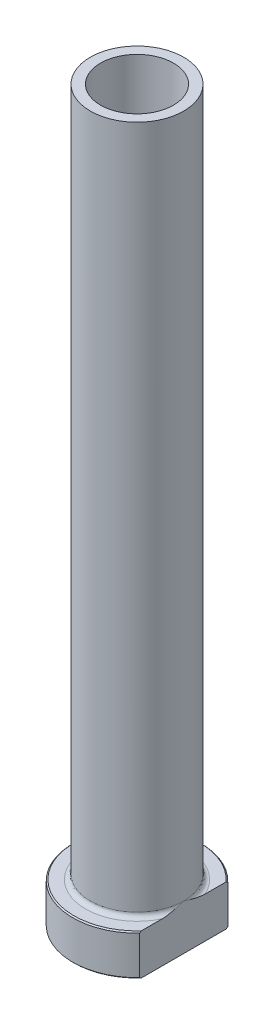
from build123d import *

# Parameters (mm, degrees)
FILLET1_R          = 0.8
CHAMFER1_SIZE      = 0.2
CUT_EXTRUDE1_DEPTH = 126.964280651
CHAMFER2_SIZE      = 0.5


with BuildPart() as part:
    # Sketch1 → Revolve1 (revolve)
    with BuildSketch(Plane.XY, mode=Mode.PRIVATE) as revolve1_sk:
        Polygon((-6.25, 125), (-8, 125), (-8, 7), (-11, 7), (-11, 0), (-6.5, 0), (-6.5, 58), (-6.25, 70), align=None)
    revolve(revolve1_sk.sketch.rotate(Axis((0, 92.187680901, 0), (0, -1, 0)), 270), axis=Axis((0, 92.187680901, 0), (0, -1, 0)))

    # Fillet1
    fillet1_edges = [part.edges().sort_by_distance(p)[0] for p in [
        (0, 7, -8),
    ]]
    fillet(fillet1_edges, radius=FILLET1_R)

    # Chamfer1
    chamfer1_edges = [part.edges().sort_by_distance(p)[0] for p in [
        (0, 0, -11),
        (0, 7, -11),
    ]]
    chamfer(chamfer1_edges, length=CHAMFER1_SIZE)

    # Sketch2 → Cut-Extrude1 (cut, through all)
    with BuildSketch(Plane.XZ):
        with BuildLine():
            Line((8, 7.549834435), (8, -7.549834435))
            ThreePointArc((8, -7.549834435), (11, 0), (8, 7.549834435))
        make_face()
    extrude(amount=-CUT_EXTRUDE1_DEPTH, mode=Mode.SUBTRACT)

    # Chamfer2
    chamfer2_edges = [part.edges().sort_by_distance(p)[0] for p in [
        (0, 0, -6.5),
    ]]
    chamfer(chamfer2_edges, length=CHAMFER2_SIZE)


solid = part.part
